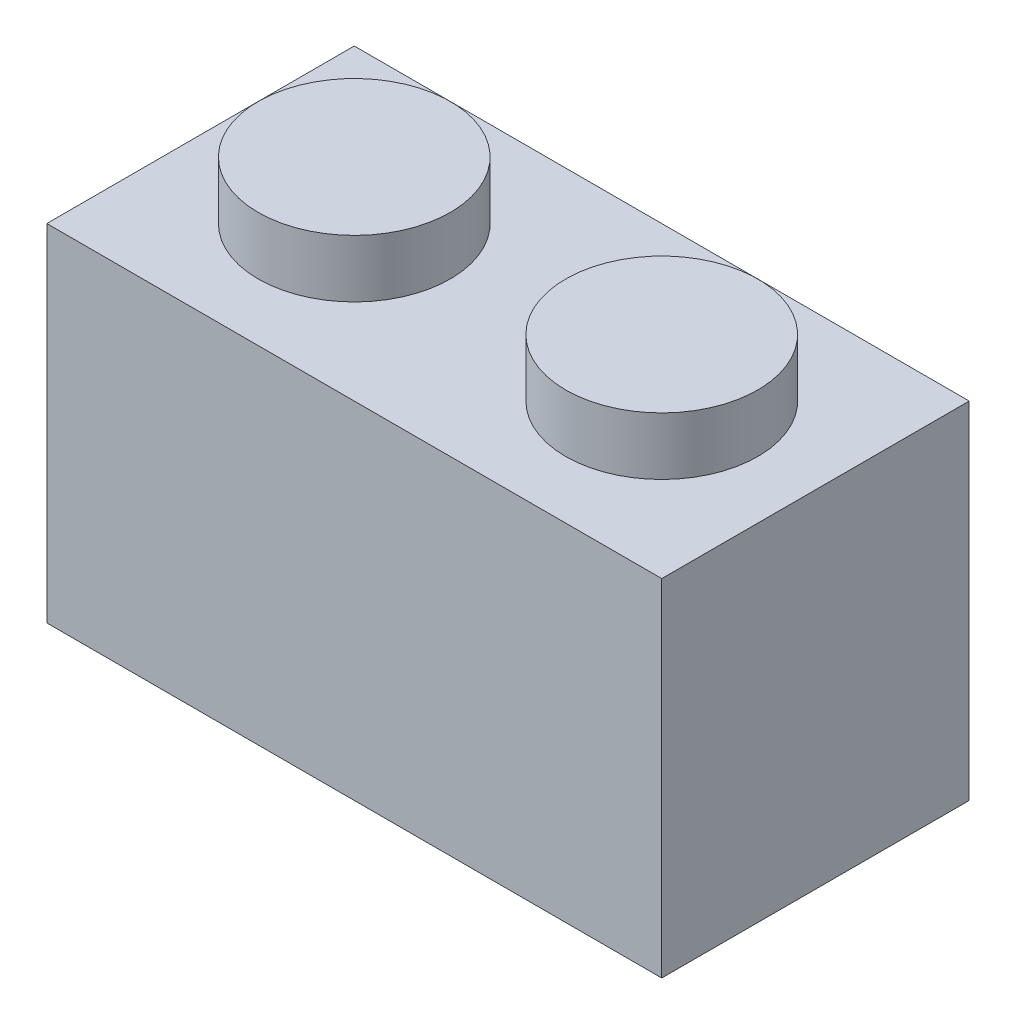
from build123d import *

# Parameters (mm, degrees)
ESQUISSE1_W      = 16
ESQUISSE1_H      = 8
EXTRUSION1_DEPTH = 1
ESQUISSE2_W      = 16
ESQUISSE2_H      = 8
ESQUISSE2_W_2    = 14
ESQUISSE2_H_2    = 6
EXTRUSION4_DEPTH = 8
ESQUISSE3_R      = 1.5
EXTRUSION5_DEPTH = 8
ESQUISSE4_R      = 2.5
EXTRUSION6_DEPTH = 1.5


with BuildPart() as part:
    # Esquisse1 → Extrusion1 (new body)
    with BuildSketch(Plane(origin=(0, 0, 0), x_dir=(1, 0, 0), z_dir=(0, 1, 0))):
        with Locations((8, -4)):
            Rectangle(ESQUISSE1_W, ESQUISSE1_H)
    extrude(amount=-EXTRUSION1_DEPTH)

    # Esquisse2 → Extrusion4 (add)
    with BuildSketch(Plane.XZ.offset(1)):
        with Locations((8, 4)):
            Rectangle(ESQUISSE2_W, ESQUISSE2_H)
        with Locations((8, 4)):
            Rectangle(ESQUISSE2_W_2, ESQUISSE2_H_2, mode=Mode.SUBTRACT)
    extrude(amount=EXTRUSION4_DEPTH)

    # Esquisse3 → Extrusion5 (add)
    with BuildSketch(Plane.XZ.offset(1)):
        with Locations(Location((8, 4, 0), (0, 0, 90))):
            Circle(ESQUISSE3_R)
    extrude(amount=EXTRUSION5_DEPTH)

    # Esquisse4 → Extrusion6 (add)
    with BuildSketch(Plane(origin=(0, 0, 0), x_dir=(-1, 0, 0), z_dir=(0, 1, 0))):
        with Locations(Location((-12, 4, 0), (0, 0, 90))):
            Circle(ESQUISSE4_R)
        with Locations(Location((-4, 4, 0), (0, 0, 90))):
            Circle(ESQUISSE4_R)
    extrude(amount=EXTRUSION6_DEPTH)


solid = part.part
